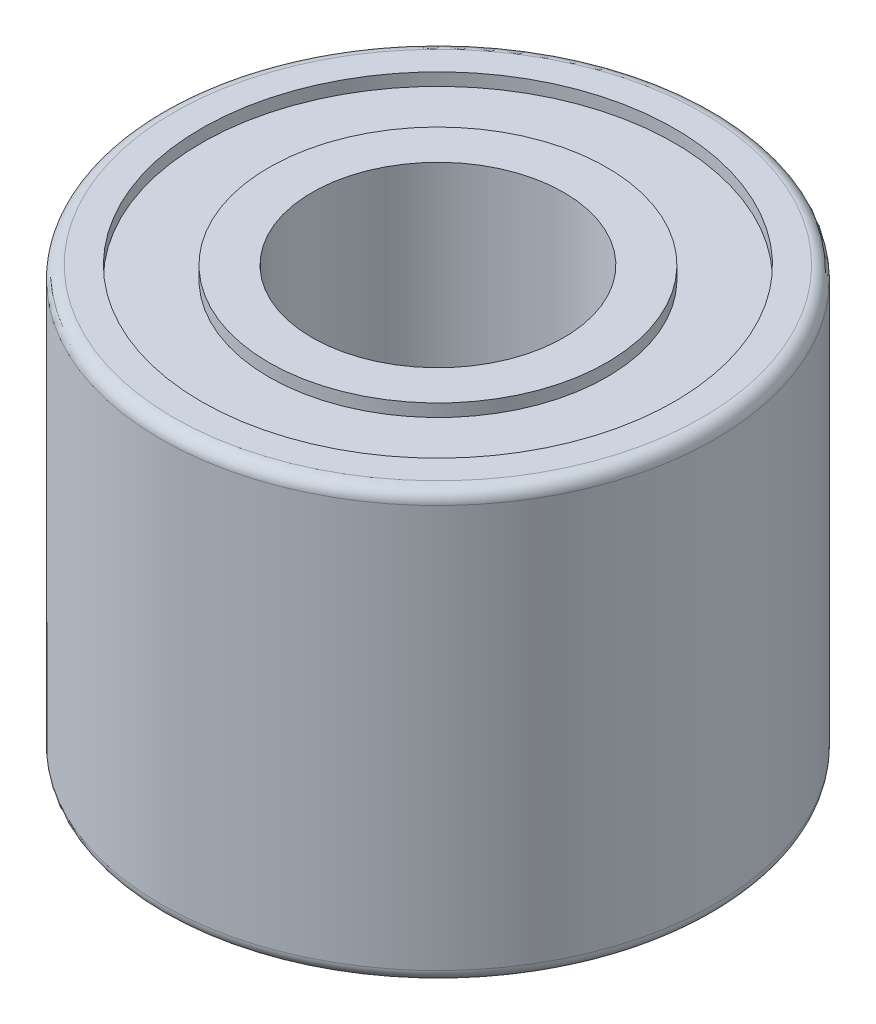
from build123d import *

# Parameters (mm, degrees)
SKETCH1_R           = 6.715
SKETCH1_R_2         = 5
BOSS_EXTRUDE1_DEPTH = 17
SKETCH4_R           = 9.4
BOSS_EXTRUDE2_DEPTH = 8
SKETCH7_R           = 11
SKETCH7_R_2         = 9.4
BOSS_EXTRUDE3_DEPTH = 17
SKETCH8_R           = 5
CUT_EXTRUDE1_DEPTH  = 17
FILLET1_R           = 0.5


with BuildPart() as part:
    # Sketch1 → Boss-Extrude1 (new body)
    with BuildSketch(Plane(origin=(0, 0, 0), x_dir=(1, 0, 0), z_dir=(0, 1, 0))):
        with Locations(Location((0, 0, 0), (0, 0, 270))):
            Circle(SKETCH1_R)
        with Locations(Location((0, 0, 0), (0, 0, 270))):
            Circle(SKETCH1_R_2, mode=Mode.SUBTRACT)
    extrude(amount=BOSS_EXTRUDE1_DEPTH)

    # Sketch4 → Boss-Extrude2 (add, symmetric)
    with BuildSketch(Plane(origin=(0, 8.5, 0), x_dir=(1, 0, 0), z_dir=(0, 1, 0))):
        with Locations(Location((0, 0, 0), (0, 0, 270))):
            Circle(SKETCH4_R)
    extrude(amount=BOSS_EXTRUDE2_DEPTH, both=True)

    # Sketch7 → Boss-Extrude3 (add)
    with BuildSketch(Plane(origin=(0, 17, 0), x_dir=(1, 0, 0), z_dir=(0, 1, 0))):
        with Locations(Location((0, 0, 0), (0, 0, 270))):
            Circle(SKETCH7_R)
        with Locations(Location((0, 0, 0), (0, 0, 270))):
            Circle(SKETCH7_R_2, mode=Mode.SUBTRACT)
    extrude(amount=-BOSS_EXTRUDE3_DEPTH)

    # Sketch8 → Cut-Extrude1 (cut)
    with BuildSketch(Plane.XZ.offset(-0.5)):
        with Locations(Location((0, 0, 0), (0, 0, 90))):
            Circle(SKETCH8_R)
    extrude(amount=-CUT_EXTRUDE1_DEPTH, mode=Mode.SUBTRACT)

    # Fillet1
    fillet1_edges = [part.edges().sort_by_distance(p)[0] for p in [
        (0, 0, -11),
        (0, 17, -11),
    ]]
    fillet(fillet1_edges, radius=FILLET1_R)


solid = part.part
